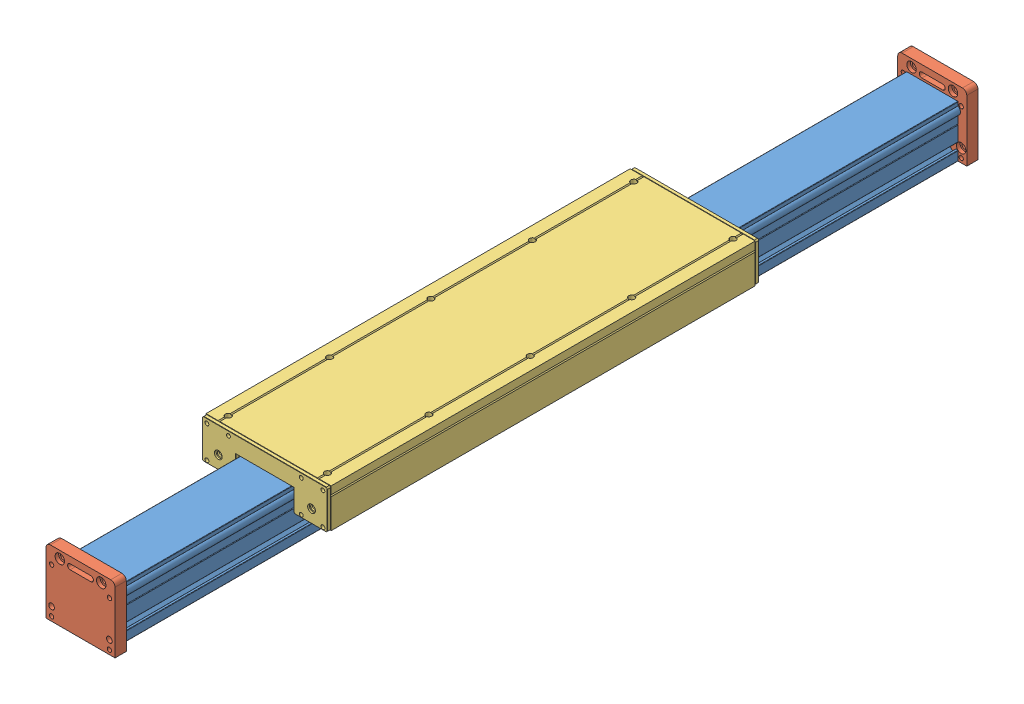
SolidWorks assembly MO_060_500_1000.SLDASM, configuration Standard (file format 3800). Lengths in mm.
Overall size (145 80 1000).
4 component instances, 3 part files, 11 mates.
Components (placement in the parent):
- Profil_MZ060-1: Profil_MZ060.SLDPRT [l=974] at (0 30 0) x (-1 0 0) z (0 0 1) size (65.5 60 974)
- Adapterplatte_MZS060-1: Adapterplatte_MZS060.SLDPRT [Standard] at (0 0 974) size (80 76 13)
- Adapterplatte_MZS060-2: Adapterplatte_MZS060.SLDPRT [Standard] x (-1 0 0) z (0 0 -1) size (80 76 13)
- Schlitten_MO_060_500-1: Schlitten_MO_060_500.SLDPRT [Standard] at (0 0 523.3445) size (145 45 500)
Mates (geometry in assembly coordinates):
- Deckungsgleich1: coincident aligned: plane of Profil_MZ060-1 through (0 30 0) normal (0 0 1)
- Deckungsgleich2: coincident anti-aligned: unknown of Profil_MZ060-1
- Deckungsgleich3: coincident anti-aligned: unknown of Profil_MZ060-1
- Deckungsgleich4: coincident anti-aligned: plane of Adapterplatte_MZS060-2 through (40 0 0) normal (0 0 1); plane of Profil_MZ060-1 through (-30 60 0) normal (0 0 -1)
- Deckungsgleich5: coincident aligned: plane of Profil_MZ060-1 through (-30 0 974) normal (0 -1 0); plane of Adapterplatte_MZS060-2 through (40 0 -13) normal (0 -1 0)
- Breite1: width: plane of Adapterplatte_MZS060-2 through (-40 0 -13) normal (-1 0 0); plane of Adapterplatte_MZS060-2 through (40 0 -13) normal (1 0 0); plane of Profil_MZ060-1 through (-30 60 974) normal (-1 0 0); plane of Profil_MZ060-1 through (30 0 974) normal (1 0 0)
- Deckungsgleich6: coincident anti-aligned: plane of Profil_MZ060-1 through (-30 60 974) normal (0 0 1); plane of Adapterplatte_MZS060-1 through (-40 0 974) normal (0 0 -1)
- Deckungsgleich7: coincident aligned: plane of Profil_MZ060-1 through (-30 0 974) normal (0 -1 0); plane of Adapterplatte_MZS060-1 through (-40 0 987) normal (0 -1 0)
- Breite2: width: plane of Adapterplatte_MZS060-1 through (-40 0 987) normal (-1 0 0); plane of Adapterplatte_MZS060-1 through (40 0 987) normal (1 0 0); plane of Profil_MZ060-1 through (30 0 974) normal (1 0 0); plane of Profil_MZ060-1 through (-30 60 974) normal (-1 0 0)
- Abstand1: distance = 80 mm: plane of Profil_MZ060-1 through (-30 0 974) normal (0 -1 0); plane of Schlitten_MO_060_500-1 through (72.5 80 769.3445) normal (0 1 0)
- Breite3: width: plane of Schlitten_MO_060_500-1 through (-72.5 80 769.3445) normal (-1 0 0); plane of Schlitten_MO_060_500-1 through (72.5 80 769.3445) normal (1 0 0); plane of Profil_MZ060-1 through (-30 60 974) normal (-1 0 0); plane of Profil_MZ060-1 through (30 0 974) normal (1 0 0)
